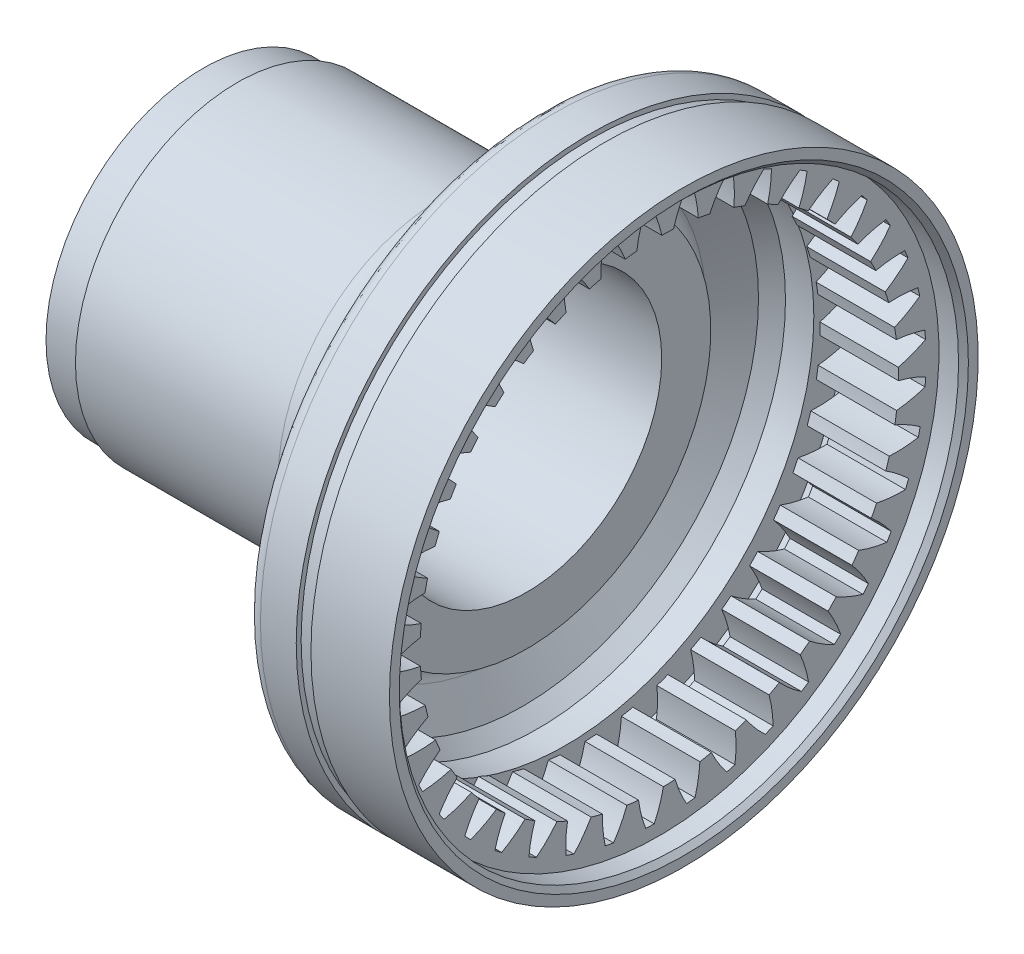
from build123d import *

# Parameters (mm, degrees)
CHANFREIN1_SIZE              = 1
CHANFREIN2_SIZE              = 1.5
CHANFREIN3_SIZE              = 1
ESQUISSE2_R                  = 4
ENL_V_MAT_EXTRU_1_DEPTH      = 13
ESQUISSE3_R                  = 15
ENL_V_MAT_EXTRU_2_DEPTH      = 13
R_P_TITION_CIRCULAIRE1_COUNT = 2
R_P_TITION_CIRCULAIRE2_COUNT = 3
ENL_V_MAT_EXTRU_3_REACH      = 127.893
R_P_TITION_CIRCULAIRE3_COUNT = 41


with BuildPart() as part:
    # Esquisse1 → Base-R_volution (revolve)
    with BuildSketch(Plane.XY, mode=Mode.PRIVATE) as base_r_volution_sk:
        with BuildLine():
            Line((-21, -57), (-21, -48.75))
            Line((-21, -48.75), (-5, -48.75))
            Line((-5, -48.75), (-5, -57))
            Line((-5, -57), (0, -57))
            Line((0, -57), (0, -60))
            Line((0, -60), (-16, -60))
            Line((-16, -60), (-16, -59))
            Line((-16, -59), (-19, -59))
            Line((-19, -59), (-19, -60))
            Line((-19, -60), (-26.290587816, -60))
            ThreePointArc((-26.290587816, -60), (-27.775811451, -59.606551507), (-28.871462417, -58.529407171))
            Line((-28.871462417, -58.529407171), (-41.095125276, -37.901976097))
            ThreePointArc((-41.095125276, -37.901976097), (-44.747295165, -34.311494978), (-49.698040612, -33))
            Line((-49.698040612, -33), (-91, -33))
            Line((-91, -33), (-91, -32))
            Line((-91, -32), (-98, -32))
            Line((-98, -32), (-98, -22))
            Line((-98, -22), (-84, -22))
            Line((-84, -22), (-84, -27.5))
            Line((-84, -27.5), (-32, -27.5))
            Line((-32, -27.5), (-32, -37.5))
            Line((-32, -37.5), (-34.612526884, -37.5))
            ThreePointArc((-34.612526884, -37.5), (-36.784653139, -38.762313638), (-36.763255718, -41.274505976))
            Line((-36.763255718, -41.274505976), (-32.777777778, -48))
            Line((-32.777777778, -48), (-29.777777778, -50.5))
            Line((-29.777777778, -50.5), (-24, -50.5))
            Line((-24, -50.5), (-24, -57))
            Line((-24, -57), (-21, -57))
        make_face()
    revolve(base_r_volution_sk.sketch.rotate(Axis((-120, 0, 0), (1, 0, 0)), 270), axis=Axis((-120, 0, 0), (1, 0, 0)))

    # Chanfrein1
    chanfrein1_edges = [part.edges().sort_by_distance(p)[0] for p in [
        (0, 0, -57),
    ]]
    chamfer(chanfrein1_edges, length=CHANFREIN1_SIZE)

    # Chanfrein2
    chanfrein2_edges = [part.edges().sort_by_distance(p)[0] for p in [
        (-98, 0, -22),
    ]]
    chamfer(chanfrein2_edges, length=CHANFREIN2_SIZE)

    # Chanfrein3
    chanfrein3_edges = [part.edges().sort_by_distance(p)[0] for p in [
        (-84, 0, -22),
    ]]
    chamfer(chanfrein3_edges, length=CHANFREIN3_SIZE)

    # Esquisse2 → Enl_v. mat.-Extru.1 (cut)
    with BuildSketch(Plane.ZY.offset(98)):
        with Locations((23.635386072, -4.167556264)):
            Circle(ESQUISSE2_R)
    enl_v_mat_extru_1 = extrude(amount=-ENL_V_MAT_EXTRU_1_DEPTH, mode=Mode.SUBTRACT)

    # Esquisse3 → Enl_v. mat.-Extru.2 (cut)
    with BuildSketch(Plane.ZY.offset(98)):
        with Locations((9.5, 0)):
            Circle(ESQUISSE3_R)
    enl_v_mat_extru_2 = extrude(amount=-ENL_V_MAT_EXTRU_2_DEPTH, mode=Mode.SUBTRACT)

    # R_p_tition circulaire1: Enl_v. mat.-Extru.1, Enl_v. mat.-Extru.2 ×2 about axis
    r_p_tition_circulaire1_axis = Axis((0, 0, 0), (1, 0, 0))
    add([enl_v_mat_extru_1.rotate(r_p_tition_circulaire1_axis, i * 360 / R_P_TITION_CIRCULAIRE1_COUNT) for i in range(1, R_P_TITION_CIRCULAIRE1_COUNT)], mode=Mode.SUBTRACT)
    add([enl_v_mat_extru_2.rotate(r_p_tition_circulaire1_axis, i * 360 / R_P_TITION_CIRCULAIRE1_COUNT) for i in range(1, R_P_TITION_CIRCULAIRE1_COUNT)], mode=Mode.SUBTRACT)

    # Esquisse4 → Per_age1 (revolve, cut)
    with BuildSketch(Plane(origin=(-98, 28, 0), x_dir=(0, 0, 1), z_dir=(0, 1, 0))):
        Polygon((0, 0), (0, 12.901290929), (1.5, 12), (1.5, 0), align=None)
    per_age1 = revolve(axis=Axis((-102.244199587, 28, 0), (1, 0, 0)), mode=Mode.SUBTRACT)

    # R_p_tition circulaire2: Per_age1 ×3 about axis
    r_p_tition_circulaire2_axis = Axis((0, 0, 0), (1, 0, 0))
    for i in range(1, R_P_TITION_CIRCULAIRE2_COUNT):
        add(per_age1.rotate(r_p_tition_circulaire2_axis, i * 360 / R_P_TITION_CIRCULAIRE2_COUNT), mode=Mode.SUBTRACT)

    # Esquisse6 → Enl_v. mat.-Extru.3 (cut, up to next)
    with BuildSketch(Plane(origin=(-5, 0, 0), x_dir=(0, 0, -1), z_dir=(1, 0, 0)), mode=Mode.PRIVATE) as enl_v_mat_extru_3_sk1:
        with BuildLine():
            Line((0.844139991, -48.742691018), (-4.242201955, -48.565072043))
            ThreePointArc((-4.242201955, -48.565072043), (-3.667768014, -51.477214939), (-2.764450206, -54.304681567))
            ThreePointArc((-2.764450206, -54.304681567), (-1.897660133, -54.341876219), (-1.03038695, -54.36523639))
            ThreePointArc((-1.03038695, -54.36523639), (0.067964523, -51.607669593), (0.844139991, -48.742691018))
        make_face()
    enl_v_mat_extru_3_tool1 = extrude(enl_v_mat_extru_3_sk1.sketch, amount=-ENL_V_MAT_EXTRU_3_REACH, mode=Mode.PRIVATE) & part.part
    enl_v_mat_extru_3 = enl_v_mat_extru_3_tool1.solids().sort_by_distance((-5, -51.061677, 1.783113))[0]
    add(enl_v_mat_extru_3, mode=Mode.SUBTRACT)

    # R_p_tition circulaire3: Enl_v. mat.-Extru.3 ×41 about axis
    r_p_tition_circulaire3_axis = Axis((0, 0, 0), (1, 0, 0))
    for i in range(1, R_P_TITION_CIRCULAIRE3_COUNT):
        add(enl_v_mat_extru_3.rotate(r_p_tition_circulaire3_axis, i * 360 / R_P_TITION_CIRCULAIRE3_COUNT), mode=Mode.SUBTRACT)


solid = part.part
